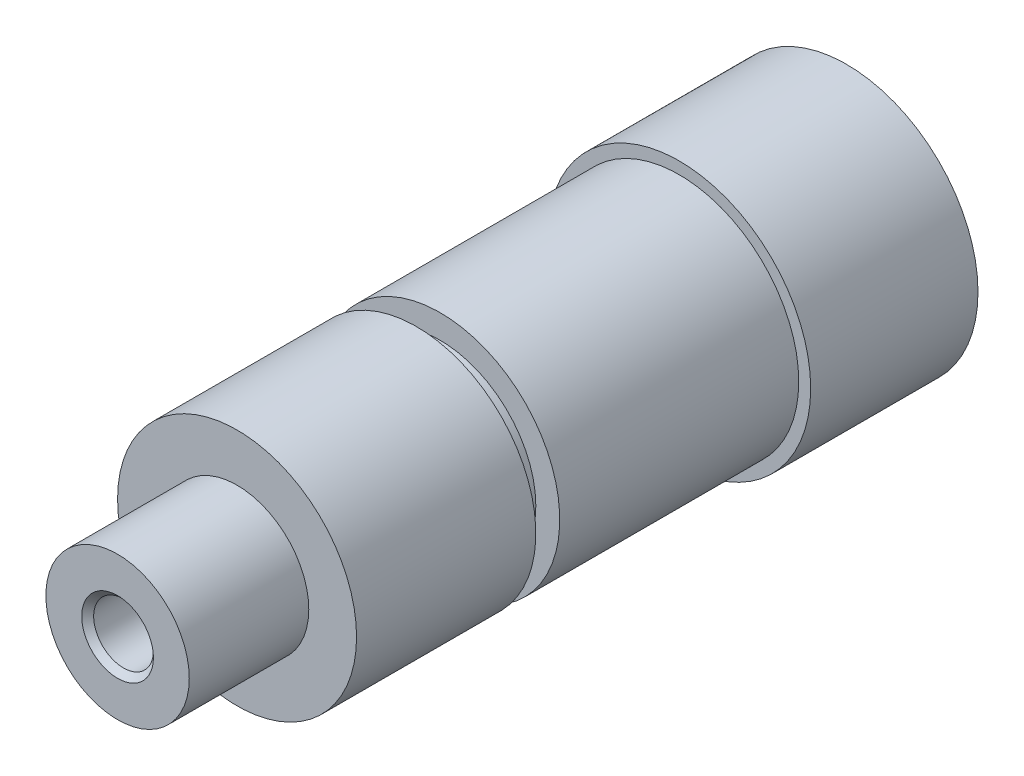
ISO-10303-21;
HEADER;
FILE_DESCRIPTION(('STEP AP214'),'2;1');
FILE_NAME('part.step','',(''),(''),'','','');
FILE_SCHEMA(('AUTOMOTIVE_DESIGN { 1 0 10303 214 1 1 1 1 }'));
ENDSEC;
DATA;
#1=APPLICATION_CONTEXT('core data for automotive mechanical design processes');
#2=APPLICATION_PROTOCOL_DEFINITION('international standard','automotive_design',2000,#1);
#3=PRODUCT_CONTEXT('',#1,'mechanical');
#4=PRODUCT('Part','Part','',(#3));
#5=PRODUCT_RELATED_PRODUCT_CATEGORY('part','',(#4));
#6=PRODUCT_DEFINITION_FORMATION('','',#4);
#7=PRODUCT_DEFINITION_CONTEXT('part definition',#1,'design');
#8=PRODUCT_DEFINITION('design','',#6,#7);
#9=PRODUCT_DEFINITION_SHAPE('','',#8);
#10=(LENGTH_UNIT() NAMED_UNIT(*) SI_UNIT(.MILLI.,.METRE.));
#11=(NAMED_UNIT(*) PLANE_ANGLE_UNIT() SI_UNIT($,.RADIAN.));
#12=(NAMED_UNIT(*) SI_UNIT($,.STERADIAN.) SOLID_ANGLE_UNIT());
#13=UNCERTAINTY_MEASURE_WITH_UNIT(LENGTH_MEASURE(1.E-05),#10,'distance_accuracy_value','');
#14=(GEOMETRIC_REPRESENTATION_CONTEXT(3) GLOBAL_UNCERTAINTY_ASSIGNED_CONTEXT((#13)) GLOBAL_UNIT_ASSIGNED_CONTEXT((#10,
#11,#12)) REPRESENTATION_CONTEXT('',''));
#15=CARTESIAN_POINT('',(0.,0.,0.));
#16=DIRECTION('',(0.,0.,1.));
#17=DIRECTION('',(1.,0.,0.));
#18=AXIS2_PLACEMENT_3D('',#15,#16,#17);
#19=CARTESIAN_POINT('',(0.,0.,51.));
#20=DIRECTION('',(0.,0.,1.));
#21=DIRECTION('',(1.,0.,0.));
#22=AXIS2_PLACEMENT_3D('',#19,#20,#21);
#23=PLANE('',#22);
#24=CARTESIAN_POINT('',(0.,0.,51.));
#25=DIRECTION('',(0.,0.,1.));
#26=DIRECTION('',(1.,0.,0.));
#27=AXIS2_PLACEMENT_3D('',#24,#25,#26);
#28=CIRCLE('',#27,10.);
#29=CARTESIAN_POINT('',(10.,0.,51.));
#30=VERTEX_POINT('',#29);
#31=EDGE_CURVE('E86',#30,#30,#28,.T.);
#32=ORIENTED_EDGE('',*,*,#31,.T.);
#33=EDGE_LOOP('',(#32));
#34=FACE_BOUND('',#33,.T.);
#35=CARTESIAN_POINT('',(0.,0.,51.));
#36=DIRECTION('',(0.,0.,1.));
#37=DIRECTION('',(1.,0.,0.));
#38=AXIS2_PLACEMENT_3D('',#35,#36,#37);
#39=CIRCLE('',#38,6.);
#40=CARTESIAN_POINT('',(6.,0.,51.));
#41=VERTEX_POINT('',#40);
#42=EDGE_CURVE('E65',#41,#41,#39,.T.);
#43=ORIENTED_EDGE('',*,*,#42,.F.);
#44=EDGE_LOOP('',(#43));
#45=FACE_BOUND('',#44,.T.);
#46=ADVANCED_FACE('F38',(#34,#45),#23,.T.);
#47=CARTESIAN_POINT('',(0.,0.,51.));
#48=DIRECTION('',(0.,0.,-1.));
#49=DIRECTION('',(-1.,0.,0.));
#50=AXIS2_PLACEMENT_3D('',#47,#48,#49);
#51=CYLINDRICAL_SURFACE('',#50,10.);
#52=CARTESIAN_POINT('',(0.,0.,14.));
#53=DIRECTION('',(0.,0.,1.));
#54=DIRECTION('',(1.,0.,0.));
#55=AXIS2_PLACEMENT_3D('',#52,#53,#54);
#56=CIRCLE('',#55,10.);
#57=CARTESIAN_POINT('',(10.,0.,14.));
#58=VERTEX_POINT('',#57);
#59=EDGE_CURVE('E83',#58,#58,#56,.T.);
#60=ORIENTED_EDGE('',*,*,#59,.T.);
#61=EDGE_LOOP('',(#60));
#62=FACE_BOUND('',#61,.T.);
#63=CARTESIAN_POINT('',(0.,0.,34.));
#64=DIRECTION('',(0.,0.,-1.));
#65=DIRECTION('',(-1.,0.,0.));
#66=AXIS2_PLACEMENT_3D('',#63,#64,#65);
#67=CIRCLE('',#66,10.);
#68=CARTESIAN_POINT('',(-10.,0.,34.));
#69=VERTEX_POINT('',#68);
#70=EDGE_CURVE('E80',#69,#69,#67,.T.);
#71=ORIENTED_EDGE('',*,*,#70,.T.);
#72=EDGE_LOOP('',(#71));
#73=FACE_BOUND('',#72,.T.);
#74=ADVANCED_FACE('F107',(#62,#73),#51,.T.);
#75=CARTESIAN_POINT('',(0.,0.,14.));
#76=DIRECTION('',(0.,0.,1.));
#77=DIRECTION('',(1.,0.,0.));
#78=AXIS2_PLACEMENT_3D('',#75,#76,#77);
#79=PLANE('',#78);
#80=CARTESIAN_POINT('',(0.,0.,14.));
#81=DIRECTION('',(0.,0.,1.));
#82=DIRECTION('',(1.,0.,0.));
#83=AXIS2_PLACEMENT_3D('',#80,#81,#82);
#84=CIRCLE('',#83,11.);
#85=CARTESIAN_POINT('',(11.,0.,14.));
#86=VERTEX_POINT('',#85);
#87=EDGE_CURVE('E11',#86,#86,#84,.T.);
#88=ORIENTED_EDGE('',*,*,#87,.T.);
#89=EDGE_LOOP('',(#88));
#90=FACE_BOUND('',#89,.T.);
#91=ORIENTED_EDGE('',*,*,#59,.F.);
#92=EDGE_LOOP('',(#91));
#93=FACE_BOUND('',#92,.T.);
#94=ADVANCED_FACE('F103',(#90,#93),#79,.T.);
#95=CARTESIAN_POINT('',(0.,0.,14.));
#96=DIRECTION('',(0.,0.,-1.));
#97=DIRECTION('',(-1.,0.,0.));
#98=AXIS2_PLACEMENT_3D('',#95,#96,#97);
#99=CYLINDRICAL_SURFACE('',#98,11.);
#100=ORIENTED_EDGE('',*,*,#87,.F.);
#101=EDGE_LOOP('',(#100));
#102=FACE_BOUND('',#101,.T.);
#103=CARTESIAN_POINT('',(0.,0.,0.));
#104=DIRECTION('',(0.,0.,1.));
#105=DIRECTION('',(1.,0.,0.));
#106=AXIS2_PLACEMENT_3D('',#103,#104,#105);
#107=CIRCLE('',#106,11.);
#108=CARTESIAN_POINT('',(11.,0.,0.));
#109=VERTEX_POINT('',#108);
#110=EDGE_CURVE('E45',#109,#109,#107,.T.);
#111=ORIENTED_EDGE('',*,*,#110,.T.);
#112=EDGE_LOOP('',(#111));
#113=FACE_BOUND('',#112,.T.);
#114=ADVANCED_FACE('F40',(#102,#113),#99,.T.);
#115=CARTESIAN_POINT('',(0.,0.,0.));
#116=DIRECTION('',(0.,0.,1.));
#117=DIRECTION('',(1.,0.,0.));
#118=AXIS2_PLACEMENT_3D('',#115,#116,#117);
#119=PLANE('',#118);
#120=ORIENTED_EDGE('',*,*,#110,.F.);
#121=EDGE_LOOP('',(#120));
#122=FACE_BOUND('',#121,.T.);
#123=ADVANCED_FACE('F92',(#122),#119,.F.);
#124=CARTESIAN_POINT('',(10.,0.,34.));
#125=DIRECTION('',(0.,0.,1.));
#126=DIRECTION('',(1.,0.,0.));
#127=AXIS2_PLACEMENT_3D('',#124,#125,#126);
#128=PLANE('',#127);
#129=CARTESIAN_POINT('',(0.,0.,34.));
#130=DIRECTION('',(0.,0.,-1.));
#131=DIRECTION('',(-1.,0.,0.));
#132=AXIS2_PLACEMENT_3D('',#129,#130,#131);
#133=CIRCLE('',#132,8.);
#134=CARTESIAN_POINT('',(-8.,0.,34.));
#135=VERTEX_POINT('',#134);
#136=EDGE_CURVE('E77',#135,#135,#133,.T.);
#137=ORIENTED_EDGE('',*,*,#136,.T.);
#138=EDGE_LOOP('',(#137));
#139=FACE_BOUND('',#138,.T.);
#140=ORIENTED_EDGE('',*,*,#70,.F.);
#141=EDGE_LOOP('',(#140));
#142=FACE_BOUND('',#141,.T.);
#143=ADVANCED_FACE('F94',(#139,#142),#128,.T.);
#144=CARTESIAN_POINT('',(0.,0.,0.));
#145=DIRECTION('',(0.,0.,-1.));
#146=DIRECTION('',(-1.,0.,0.));
#147=AXIS2_PLACEMENT_3D('',#144,#145,#146);
#148=CYLINDRICAL_SURFACE('',#147,8.);
#149=CARTESIAN_POINT('',(0.,0.,36.));
#150=DIRECTION('',(0.,0.,-1.));
#151=DIRECTION('',(-1.,0.,0.));
#152=AXIS2_PLACEMENT_3D('',#149,#150,#151);
#153=CIRCLE('',#152,8.);
#154=CARTESIAN_POINT('',(-8.,0.,36.));
#155=VERTEX_POINT('',#154);
#156=EDGE_CURVE('E74',#155,#155,#153,.T.);
#157=ORIENTED_EDGE('',*,*,#156,.T.);
#158=EDGE_LOOP('',(#157));
#159=FACE_BOUND('',#158,.T.);
#160=ORIENTED_EDGE('',*,*,#136,.F.);
#161=EDGE_LOOP('',(#160));
#162=FACE_BOUND('',#161,.T.);
#163=ADVANCED_FACE('F100',(#159,#162),#148,.T.);
#164=CARTESIAN_POINT('',(8.,0.,36.));
#165=DIRECTION('',(0.,0.,-1.));
#166=DIRECTION('',(-1.,0.,0.));
#167=AXIS2_PLACEMENT_3D('',#164,#165,#166);
#168=PLANE('',#167);
#169=CARTESIAN_POINT('',(0.,0.,36.));
#170=DIRECTION('',(0.,0.,-1.));
#171=DIRECTION('',(-1.,0.,0.));
#172=AXIS2_PLACEMENT_3D('',#169,#170,#171);
#173=CIRCLE('',#172,10.);
#174=CARTESIAN_POINT('',(-10.,0.,36.));
#175=VERTEX_POINT('',#174);
#176=EDGE_CURVE('E71',#175,#175,#173,.T.);
#177=ORIENTED_EDGE('',*,*,#176,.T.);
#178=EDGE_LOOP('',(#177));
#179=FACE_BOUND('',#178,.T.);
#180=ORIENTED_EDGE('',*,*,#156,.F.);
#181=EDGE_LOOP('',(#180));
#182=FACE_BOUND('',#181,.T.);
#183=ADVANCED_FACE('F119',(#179,#182),#168,.T.);
#184=ORIENTED_EDGE('',*,*,#31,.F.);
#185=EDGE_LOOP('',(#184));
#186=FACE_BOUND('',#185,.T.);
#187=ORIENTED_EDGE('',*,*,#176,.F.);
#188=EDGE_LOOP('',(#187));
#189=FACE_BOUND('',#188,.T.);
#190=ADVANCED_FACE('F114',(#186,#189),#51,.T.);
#191=CARTESIAN_POINT('',(0.,0.,61.));
#192=DIRECTION('',(0.,0.,-1.));
#193=DIRECTION('',(-1.,0.,0.));
#194=AXIS2_PLACEMENT_3D('',#191,#192,#193);
#195=CYLINDRICAL_SURFACE('',#194,6.);
#196=CARTESIAN_POINT('',(0.,0.,61.));
#197=DIRECTION('',(0.,0.,1.));
#198=DIRECTION('',(1.,0.,0.));
#199=AXIS2_PLACEMENT_3D('',#196,#197,#198);
#200=CIRCLE('',#199,6.);
#201=CARTESIAN_POINT('',(6.,0.,61.));
#202=VERTEX_POINT('',#201);
#203=EDGE_CURVE('E68',#202,#202,#200,.T.);
#204=ORIENTED_EDGE('',*,*,#203,.F.);
#205=EDGE_LOOP('',(#204));
#206=FACE_BOUND('',#205,.T.);
#207=ORIENTED_EDGE('',*,*,#42,.T.);
#208=EDGE_LOOP('',(#207));
#209=FACE_BOUND('',#208,.T.);
#210=ADVANCED_FACE('F124',(#206,#209),#195,.T.);
#211=CARTESIAN_POINT('',(0.,0.,61.));
#212=DIRECTION('',(0.,0.,1.));
#213=DIRECTION('',(1.,0.,0.));
#214=AXIS2_PLACEMENT_3D('',#211,#212,#213);
#215=PLANE('',#214);
#216=CARTESIAN_POINT('',(0.,0.,61.));
#217=DIRECTION('',(0.,0.,1.));
#218=DIRECTION('',(1.,0.,0.));
#219=AXIS2_PLACEMENT_3D('',#216,#217,#218);
#220=CIRCLE('',#219,3.);
#221=CARTESIAN_POINT('',(3.,0.,61.));
#222=VERTEX_POINT('',#221);
#223=EDGE_CURVE('E60',#222,#222,#220,.T.);
#224=ORIENTED_EDGE('',*,*,#223,.F.);
#225=EDGE_LOOP('',(#224));
#226=FACE_BOUND('',#225,.T.);
#227=ORIENTED_EDGE('',*,*,#203,.T.);
#228=EDGE_LOOP('',(#227));
#229=FACE_BOUND('',#228,.T.);
#230=ADVANCED_FACE('F127',(#226,#229),#215,.T.);
#231=CARTESIAN_POINT('',(0.,0.,61.));
#232=DIRECTION('',(0.,0.,1.));
#233=DIRECTION('',(1.,0.,0.));
#234=AXIS2_PLACEMENT_3D('',#231,#232,#233);
#235=CONICAL_SURFACE('',#234,3.,0.785398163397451);
#236=CARTESIAN_POINT('',(0.,0.,60.5));
#237=DIRECTION('',(0.,0.,1.));
#238=DIRECTION('',(1.,0.,0.));
#239=AXIS2_PLACEMENT_3D('',#236,#237,#238);
#240=CIRCLE('',#239,2.5);
#241=CARTESIAN_POINT('',(2.5,0.,60.5));
#242=VERTEX_POINT('',#241);
#243=EDGE_CURVE('E57',#242,#242,#240,.T.);
#244=ORIENTED_EDGE('',*,*,#243,.F.);
#245=EDGE_LOOP('',(#244));
#246=FACE_BOUND('',#245,.T.);
#247=ORIENTED_EDGE('',*,*,#223,.T.);
#248=EDGE_LOOP('',(#247));
#249=FACE_BOUND('',#248,.T.);
#250=ADVANCED_FACE('F131',(#246,#249),#235,.F.);
#251=CARTESIAN_POINT('',(0.,0.,61.));
#252=DIRECTION('',(0.,0.,1.));
#253=DIRECTION('',(1.,0.,0.));
#254=AXIS2_PLACEMENT_3D('',#251,#252,#253);
#255=CYLINDRICAL_SURFACE('',#254,2.5);
#256=CARTESIAN_POINT('',(0.,0.,42.));
#257=DIRECTION('',(0.,0.,1.));
#258=DIRECTION('',(1.,0.,0.));
#259=AXIS2_PLACEMENT_3D('',#256,#257,#258);
#260=CIRCLE('',#259,2.5);
#261=CARTESIAN_POINT('',(2.5,0.,42.));
#262=VERTEX_POINT('',#261);
#263=EDGE_CURVE('E55',#262,#262,#260,.T.);
#264=ORIENTED_EDGE('',*,*,#263,.F.);
#265=EDGE_LOOP('',(#264));
#266=FACE_BOUND('',#265,.T.);
#267=ORIENTED_EDGE('',*,*,#243,.T.);
#268=EDGE_LOOP('',(#267));
#269=FACE_BOUND('',#268,.T.);
#270=ADVANCED_FACE('F51',(#266,#269),#255,.F.);
#271=CARTESIAN_POINT('',(0.,0.,42.));
#272=DIRECTION('',(0.,0.,1.));
#273=DIRECTION('',(1.,0.,0.));
#274=AXIS2_PLACEMENT_3D('',#271,#272,#273);
#275=CONICAL_SURFACE('',#274,2.5,1.02974425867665);
#276=CARTESIAN_POINT('',(0.,0.,40.4978484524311));
#277=VERTEX_POINT('',#276);
#278=VERTEX_LOOP('',#277);
#279=FACE_BOUND('',#278,.T.);
#280=ORIENTED_EDGE('',*,*,#263,.T.);
#281=EDGE_LOOP('',(#280));
#282=FACE_BOUND('',#281,.T.);
#283=ADVANCED_FACE('F48',(#279,#282),#275,.F.);
#284=CLOSED_SHELL('',(#46,#74,#94,#114,#123,#143,#163,#183,#190,#210,#230,#250,#270,#283));
#285=MANIFOLD_SOLID_BREP('B2',#284);
#286=ADVANCED_BREP_SHAPE_REPRESENTATION('',(#18,#285),#14);
#287=SHAPE_DEFINITION_REPRESENTATION(#9,#286);
ENDSEC;
END-ISO-10303-21;
